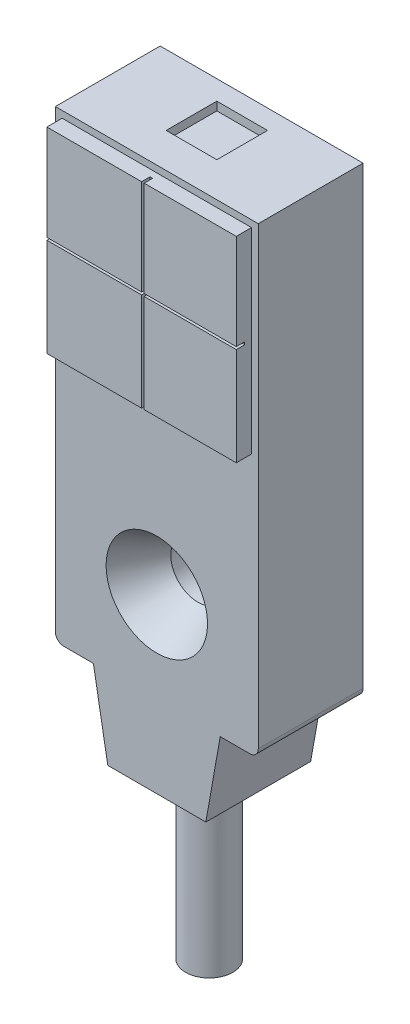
ISO-10303-21;
HEADER;
FILE_DESCRIPTION(('STEP AP214'),'2;1');
FILE_NAME('part.step','',(''),(''),'','','');
FILE_SCHEMA(('AUTOMOTIVE_DESIGN { 1 0 10303 214 1 1 1 1 }'));
ENDSEC;
DATA;
#1=APPLICATION_CONTEXT('core data for automotive mechanical design processes');
#2=APPLICATION_PROTOCOL_DEFINITION('international standard','automotive_design',2000,#1);
#3=PRODUCT_CONTEXT('',#1,'mechanical');
#4=PRODUCT('Part','Part','',(#3));
#5=PRODUCT_RELATED_PRODUCT_CATEGORY('part','',(#4));
#6=PRODUCT_DEFINITION_FORMATION('','',#4);
#7=PRODUCT_DEFINITION_CONTEXT('part definition',#1,'design');
#8=PRODUCT_DEFINITION('design','',#6,#7);
#9=PRODUCT_DEFINITION_SHAPE('','',#8);
#10=(LENGTH_UNIT() NAMED_UNIT(*) SI_UNIT(.MILLI.,.METRE.));
#11=(NAMED_UNIT(*) PLANE_ANGLE_UNIT() SI_UNIT($,.RADIAN.));
#12=(NAMED_UNIT(*) SI_UNIT($,.STERADIAN.) SOLID_ANGLE_UNIT());
#13=UNCERTAINTY_MEASURE_WITH_UNIT(LENGTH_MEASURE(1.E-05),#10,'distance_accuracy_value','');
#14=(GEOMETRIC_REPRESENTATION_CONTEXT(3) GLOBAL_UNCERTAINTY_ASSIGNED_CONTEXT((#13)) GLOBAL_UNIT_ASSIGNED_CONTEXT((#10,
#11,#12)) REPRESENTATION_CONTEXT('',''));
#15=CARTESIAN_POINT('',(0.,0.,0.));
#16=DIRECTION('',(0.,0.,1.));
#17=DIRECTION('',(1.,0.,0.));
#18=AXIS2_PLACEMENT_3D('',#15,#16,#17);
#19=CARTESIAN_POINT('',(0.,0.,7.1));
#20=DIRECTION('',(0.,0.,-1.));
#21=DIRECTION('',(-1.,0.,0.));
#22=AXIS2_PLACEMENT_3D('',#19,#20,#21);
#23=PLANE('',#22);
#24=DIRECTION('',(-1.,0.,0.));
#25=VECTOR('',#24,1.);
#26=CARTESIAN_POINT('',(0.4,27.,7.1));
#27=LINE('',#26,#25);
#28=CARTESIAN_POINT('',(11.6,27.,7.1));
#29=VERTEX_POINT('',#28);
#30=CARTESIAN_POINT('',(6.15,27.,7.1));
#31=VERTEX_POINT('',#30);
#32=EDGE_CURVE('E363',#29,#31,#27,.T.);
#33=ORIENTED_EDGE('',*,*,#32,.T.);
#34=DIRECTION('',(0.,1.,0.));
#35=VECTOR('',#34,1.);
#36=CARTESIAN_POINT('',(6.15,27.,7.1));
#37=LINE('',#36,#35);
#38=CARTESIAN_POINT('',(6.15,21.35,7.1));
#39=VERTEX_POINT('',#38);
#40=EDGE_CURVE('E280',#39,#31,#37,.T.);
#41=ORIENTED_EDGE('',*,*,#40,.F.);
#42=DIRECTION('',(-1.,0.,0.));
#43=VECTOR('',#42,1.);
#44=CARTESIAN_POINT('',(6.15,21.35,7.1));
#45=LINE('',#44,#43);
#46=CARTESIAN_POINT('',(11.6,21.35,7.1));
#47=VERTEX_POINT('',#46);
#48=EDGE_CURVE('E326',#47,#39,#45,.T.);
#49=ORIENTED_EDGE('',*,*,#48,.F.);
#50=DIRECTION('',(0.,1.,0.));
#51=VECTOR('',#50,1.);
#52=CARTESIAN_POINT('',(11.6,27.,7.1));
#53=LINE('',#52,#51);
#54=EDGE_CURVE('E362',#47,#29,#53,.T.);
#55=ORIENTED_EDGE('',*,*,#54,.T.);
#56=EDGE_LOOP('',(#33,#41,#49,#55));
#57=FACE_BOUND('',#56,.T.);
#58=ADVANCED_FACE('F35',(#57),#23,.F.);
#59=CARTESIAN_POINT('',(11.6,15.4,7.1));
#60=VERTEX_POINT('',#59);
#61=CARTESIAN_POINT('',(11.6,21.2,7.1));
#62=VERTEX_POINT('',#61);
#63=EDGE_CURVE('E358',#60,#62,#53,.T.);
#64=ORIENTED_EDGE('',*,*,#63,.T.);
#65=DIRECTION('',(1.,0.,0.));
#66=VECTOR('',#65,1.);
#67=CARTESIAN_POINT('',(11.6,21.2,7.1));
#68=LINE('',#67,#66);
#69=CARTESIAN_POINT('',(6.15,21.2,7.1));
#70=VERTEX_POINT('',#69);
#71=EDGE_CURVE('E324',#70,#62,#68,.T.);
#72=ORIENTED_EDGE('',*,*,#71,.F.);
#73=DIRECTION('',(0.,1.,0.));
#74=VECTOR('',#73,1.);
#75=CARTESIAN_POINT('',(6.15,21.2,7.1));
#76=LINE('',#75,#74);
#77=CARTESIAN_POINT('',(6.15,15.4,7.1));
#78=VERTEX_POINT('',#77);
#79=EDGE_CURVE('E321',#78,#70,#76,.T.);
#80=ORIENTED_EDGE('',*,*,#79,.F.);
#81=DIRECTION('',(1.,0.,0.));
#82=VECTOR('',#81,1.);
#83=CARTESIAN_POINT('',(11.6,15.4,7.1));
#84=LINE('',#83,#82);
#85=EDGE_CURVE('E370',#78,#60,#84,.T.);
#86=ORIENTED_EDGE('',*,*,#85,.T.);
#87=EDGE_LOOP('',(#64,#72,#80,#86));
#88=FACE_BOUND('',#87,.T.);
#89=ADVANCED_FACE('F564',(#88),#23,.F.);
#90=CARTESIAN_POINT('',(0.4,15.4,7.1));
#91=VERTEX_POINT('',#90);
#92=CARTESIAN_POINT('',(6.,15.4,7.1));
#93=VERTEX_POINT('',#92);
#94=EDGE_CURVE('E371',#91,#93,#84,.T.);
#95=ORIENTED_EDGE('',*,*,#94,.T.);
#96=DIRECTION('',(0.,-1.,0.));
#97=VECTOR('',#96,1.);
#98=CARTESIAN_POINT('',(6.,21.2,7.1));
#99=LINE('',#98,#97);
#100=CARTESIAN_POINT('',(6.,21.2,7.1));
#101=VERTEX_POINT('',#100);
#102=EDGE_CURVE('E319',#101,#93,#99,.T.);
#103=ORIENTED_EDGE('',*,*,#102,.F.);
#104=DIRECTION('',(1.,0.,0.));
#105=VECTOR('',#104,1.);
#106=CARTESIAN_POINT('',(6.,21.2,7.1));
#107=LINE('',#106,#105);
#108=CARTESIAN_POINT('',(0.4,21.2,7.1));
#109=VERTEX_POINT('',#108);
#110=EDGE_CURVE('E316',#109,#101,#107,.T.);
#111=ORIENTED_EDGE('',*,*,#110,.F.);
#112=DIRECTION('',(0.,-1.,0.));
#113=VECTOR('',#112,1.);
#114=CARTESIAN_POINT('',(0.4,15.4,7.1));
#115=LINE('',#114,#113);
#116=EDGE_CURVE('E366',#109,#91,#115,.T.);
#117=ORIENTED_EDGE('',*,*,#116,.T.);
#118=EDGE_LOOP('',(#95,#103,#111,#117));
#119=FACE_BOUND('',#118,.T.);
#120=ADVANCED_FACE('F571',(#119),#23,.F.);
#121=CARTESIAN_POINT('',(11.5,0.5,6.2));
#122=DIRECTION('',(0.,0.,-1.));
#123=DIRECTION('',(-1.,0.,0.));
#124=AXIS2_PLACEMENT_3D('',#121,#122,#123);
#125=PLANE('',#124);
#126=CARTESIAN_POINT('',(6.,5.4,6.2));
#127=DIRECTION('',(0.,0.,-1.));
#128=DIRECTION('',(-1.,0.,0.));
#129=AXIS2_PLACEMENT_3D('',#126,#127,#128);
#130=CIRCLE('',#129,3.00000000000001);
#131=CARTESIAN_POINT('',(2.99999999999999,5.4,6.2));
#132=VERTEX_POINT('',#131);
#133=EDGE_CURVE('E43',#132,#132,#130,.T.);
#134=ORIENTED_EDGE('',*,*,#133,.T.);
#135=EDGE_LOOP('',(#134));
#136=FACE_BOUND('',#135,.T.);
#137=DIRECTION('',(-1.,0.,0.));
#138=VECTOR('',#137,1.);
#139=CARTESIAN_POINT('',(0.,27.4,6.2));
#140=LINE('',#139,#138);
#141=CARTESIAN_POINT('',(12.,27.4,6.2));
#142=VERTEX_POINT('',#141);
#143=CARTESIAN_POINT('',(0.,27.4,6.2));
#144=VERTEX_POINT('',#143);
#145=EDGE_CURVE('E398',#142,#144,#140,.T.);
#146=ORIENTED_EDGE('',*,*,#145,.T.);
#147=DIRECTION('',(0.,-1.,0.));
#148=VECTOR('',#147,1.);
#149=CARTESIAN_POINT('',(0.,0.500000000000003,6.2));
#150=LINE('',#149,#148);
#151=CARTESIAN_POINT('',(0.,0.500000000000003,6.2));
#152=VERTEX_POINT('',#151);
#153=EDGE_CURVE('E401',#144,#152,#150,.T.);
#154=ORIENTED_EDGE('',*,*,#153,.T.);
#155=CARTESIAN_POINT('',(0.5,0.5,6.2));
#156=DIRECTION('',(0.,0.,1.));
#157=DIRECTION('',(1.,0.,0.));
#158=AXIS2_PLACEMENT_3D('',#155,#156,#157);
#159=CIRCLE('',#158,0.5);
#160=CARTESIAN_POINT('',(0.500000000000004,0.,6.2));
#161=VERTEX_POINT('',#160);
#162=EDGE_CURVE('E404',#152,#161,#159,.T.);
#163=ORIENTED_EDGE('',*,*,#162,.T.);
#164=DIRECTION('',(1.,0.,0.));
#165=VECTOR('',#164,1.);
#166=CARTESIAN_POINT('',(0.500000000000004,0.,6.2));
#167=LINE('',#166,#165);
#168=CARTESIAN_POINT('',(2.25,0.,6.2));
#169=VERTEX_POINT('',#168);
#170=EDGE_CURVE('E406',#161,#169,#167,.T.);
#171=ORIENTED_EDGE('',*,*,#170,.T.);
#172=DIRECTION('',(0.174370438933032,-0.984680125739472,0.));
#173=VECTOR('',#172,1.);
#174=CARTESIAN_POINT('',(3.1,-4.8,6.2));
#175=LINE('',#174,#173);
#176=CARTESIAN_POINT('',(3.1,-4.8,6.2));
#177=VERTEX_POINT('',#176);
#178=EDGE_CURVE('E408',#169,#177,#175,.T.);
#179=ORIENTED_EDGE('',*,*,#178,.T.);
#180=DIRECTION('',(1.,0.,0.));
#181=VECTOR('',#180,1.);
#182=CARTESIAN_POINT('',(6.,-4.8,6.2));
#183=LINE('',#182,#181);
#184=CARTESIAN_POINT('',(8.9,-4.8,6.2));
#185=VERTEX_POINT('',#184);
#186=EDGE_CURVE('E410',#177,#185,#183,.T.);
#187=ORIENTED_EDGE('',*,*,#186,.T.);
#188=DIRECTION('',(0.174370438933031,0.984680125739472,0.));
#189=VECTOR('',#188,1.);
#190=CARTESIAN_POINT('',(8.9,-4.8,6.2));
#191=LINE('',#190,#189);
#192=CARTESIAN_POINT('',(9.75,0.,6.2));
#193=VERTEX_POINT('',#192);
#194=EDGE_CURVE('E412',#185,#193,#191,.T.);
#195=ORIENTED_EDGE('',*,*,#194,.T.);
#196=DIRECTION('',(1.,0.,0.));
#197=VECTOR('',#196,1.);
#198=CARTESIAN_POINT('',(11.5,0.,6.2));
#199=LINE('',#198,#197);
#200=CARTESIAN_POINT('',(11.5,0.,6.2));
#201=VERTEX_POINT('',#200);
#202=EDGE_CURVE('E414',#193,#201,#199,.T.);
#203=ORIENTED_EDGE('',*,*,#202,.T.);
#204=CARTESIAN_POINT('',(11.5,0.5,6.2));
#205=DIRECTION('',(0.,0.,1.));
#206=DIRECTION('',(-1.,0.,0.));
#207=AXIS2_PLACEMENT_3D('',#204,#205,#206);
#208=CIRCLE('',#207,0.5);
#209=CARTESIAN_POINT('',(12.,0.500000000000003,6.2));
#210=VERTEX_POINT('',#209);
#211=EDGE_CURVE('E416',#201,#210,#208,.T.);
#212=ORIENTED_EDGE('',*,*,#211,.T.);
#213=DIRECTION('',(0.,1.,0.));
#214=VECTOR('',#213,1.);
#215=CARTESIAN_POINT('',(12.,27.4,6.2));
#216=LINE('',#215,#214);
#217=EDGE_CURVE('E418',#210,#142,#216,.T.);
#218=ORIENTED_EDGE('',*,*,#217,.T.);
#219=EDGE_LOOP('',(#146,#154,#163,#171,#179,#187,#195,#203,#212,#218));
#220=FACE_BOUND('',#219,.T.);
#221=DIRECTION('',(0.,1.,0.));
#222=VECTOR('',#221,1.);
#223=CARTESIAN_POINT('',(11.6,27.,6.2));
#224=LINE('',#223,#222);
#225=CARTESIAN_POINT('',(11.6,15.4,6.2));
#226=VERTEX_POINT('',#225);
#227=CARTESIAN_POINT('',(11.6,27.,6.2));
#228=VERTEX_POINT('',#227);
#229=EDGE_CURVE('E333',#226,#228,#224,.T.);
#230=ORIENTED_EDGE('',*,*,#229,.F.);
#231=DIRECTION('',(1.,0.,0.));
#232=VECTOR('',#231,1.);
#233=CARTESIAN_POINT('',(11.6,15.4,6.2));
#234=LINE('',#233,#232);
#235=CARTESIAN_POINT('',(0.399999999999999,15.4,6.2));
#236=VERTEX_POINT('',#235);
#237=EDGE_CURVE('E383',#236,#226,#234,.T.);
#238=ORIENTED_EDGE('',*,*,#237,.F.);
#239=DIRECTION('',(0.,-1.,0.));
#240=VECTOR('',#239,1.);
#241=CARTESIAN_POINT('',(0.4,15.4,6.2));
#242=LINE('',#241,#240);
#243=CARTESIAN_POINT('',(0.399999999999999,27.,6.2));
#244=VERTEX_POINT('',#243);
#245=EDGE_CURVE('E380',#244,#236,#242,.T.);
#246=ORIENTED_EDGE('',*,*,#245,.F.);
#247=DIRECTION('',(-1.,0.,0.));
#248=VECTOR('',#247,1.);
#249=CARTESIAN_POINT('',(0.4,27.,6.2));
#250=LINE('',#249,#248);
#251=EDGE_CURVE('E377',#228,#244,#250,.T.);
#252=ORIENTED_EDGE('',*,*,#251,.F.);
#253=EDGE_LOOP('',(#230,#238,#246,#252));
#254=FACE_BOUND('',#253,.T.);
#255=ADVANCED_FACE('F475',(#136,#220,#254),#125,.F.);
#256=CARTESIAN_POINT('',(0.,27.4,6.2));
#257=DIRECTION('',(0.,-1.,0.));
#258=DIRECTION('',(0.,0.,-1.));
#259=AXIS2_PLACEMENT_3D('',#256,#257,#258);
#260=PLANE('',#259);
#261=DIRECTION('',(-1.,0.,0.));
#262=VECTOR('',#261,1.);
#263=CARTESIAN_POINT('',(6.,27.4,1.15));
#264=LINE('',#263,#262);
#265=CARTESIAN_POINT('',(7.5,27.4,1.15));
#266=VERTEX_POINT('',#265);
#267=CARTESIAN_POINT('',(4.5,27.4,1.15));
#268=VERTEX_POINT('',#267);
#269=EDGE_CURVE('E248',#266,#268,#264,.T.);
#270=ORIENTED_EDGE('',*,*,#269,.F.);
#271=DIRECTION('',(0.,0.,-1.));
#272=VECTOR('',#271,1.);
#273=CARTESIAN_POINT('',(7.5,27.4,4.15));
#274=LINE('',#273,#272);
#275=CARTESIAN_POINT('',(7.5,27.4,4.15));
#276=VERTEX_POINT('',#275);
#277=EDGE_CURVE('E50',#276,#266,#274,.T.);
#278=ORIENTED_EDGE('',*,*,#277,.F.);
#279=DIRECTION('',(1.,0.,0.));
#280=VECTOR('',#279,1.);
#281=CARTESIAN_POINT('',(4.5,27.4,4.15));
#282=LINE('',#281,#280);
#283=CARTESIAN_POINT('',(4.5,27.4,4.15));
#284=VERTEX_POINT('',#283);
#285=EDGE_CURVE('E266',#284,#276,#282,.T.);
#286=ORIENTED_EDGE('',*,*,#285,.F.);
#287=DIRECTION('',(0.,0.,1.));
#288=VECTOR('',#287,1.);
#289=CARTESIAN_POINT('',(4.5,27.4,1.15));
#290=LINE('',#289,#288);
#291=EDGE_CURVE('E263',#268,#284,#290,.T.);
#292=ORIENTED_EDGE('',*,*,#291,.F.);
#293=EDGE_LOOP('',(#270,#278,#286,#292));
#294=FACE_BOUND('',#293,.T.);
#295=DIRECTION('',(-1.,0.,0.));
#296=VECTOR('',#295,1.);
#297=CARTESIAN_POINT('',(0.,27.4,0.));
#298=LINE('',#297,#296);
#299=CARTESIAN_POINT('',(12.,27.4,0.));
#300=VERTEX_POINT('',#299);
#301=CARTESIAN_POINT('',(0.,27.4,0.));
#302=VERTEX_POINT('',#301);
#303=EDGE_CURVE('E397',#300,#302,#298,.T.);
#304=ORIENTED_EDGE('',*,*,#303,.T.);
#305=DIRECTION('',(0.,0.,-1.));
#306=VECTOR('',#305,1.);
#307=CARTESIAN_POINT('',(0.,27.4,6.2));
#308=LINE('',#307,#306);
#309=EDGE_CURVE('E467',#144,#302,#308,.T.);
#310=ORIENTED_EDGE('',*,*,#309,.F.);
#311=ORIENTED_EDGE('',*,*,#145,.F.);
#312=DIRECTION('',(0.,0.,-1.));
#313=VECTOR('',#312,1.);
#314=CARTESIAN_POINT('',(12.,27.4,6.2));
#315=LINE('',#314,#313);
#316=EDGE_CURVE('E420',#142,#300,#315,.T.);
#317=ORIENTED_EDGE('',*,*,#316,.T.);
#318=EDGE_LOOP('',(#304,#310,#311,#317));
#319=FACE_BOUND('',#318,.T.);
#320=ADVANCED_FACE('F550',(#294,#319),#260,.F.);
#321=CARTESIAN_POINT('',(0.,0.500000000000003,6.2));
#322=DIRECTION('',(1.,0.,0.));
#323=DIRECTION('',(0.,0.,-1.));
#324=AXIS2_PLACEMENT_3D('',#321,#322,#323);
#325=PLANE('',#324);
#326=DIRECTION('',(0.,-1.,0.));
#327=VECTOR('',#326,1.);
#328=CARTESIAN_POINT('',(0.,0.500000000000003,0.));
#329=LINE('',#328,#327);
#330=CARTESIAN_POINT('',(0.,0.500000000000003,0.));
#331=VERTEX_POINT('',#330);
#332=EDGE_CURVE('E423',#302,#331,#329,.T.);
#333=ORIENTED_EDGE('',*,*,#332,.T.);
#334=DIRECTION('',(0.,0.,-1.));
#335=VECTOR('',#334,1.);
#336=CARTESIAN_POINT('',(0.,0.500000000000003,6.2));
#337=LINE('',#336,#335);
#338=EDGE_CURVE('E464',#152,#331,#337,.T.);
#339=ORIENTED_EDGE('',*,*,#338,.F.);
#340=ORIENTED_EDGE('',*,*,#153,.F.);
#341=ORIENTED_EDGE('',*,*,#309,.T.);
#342=EDGE_LOOP('',(#333,#339,#340,#341));
#343=FACE_BOUND('',#342,.T.);
#344=ADVANCED_FACE('F547',(#343),#325,.F.);
#345=CARTESIAN_POINT('',(0.5,0.5,6.2));
#346=DIRECTION('',(0.,0.,-1.));
#347=DIRECTION('',(-1.,0.,0.));
#348=AXIS2_PLACEMENT_3D('',#345,#346,#347);
#349=CYLINDRICAL_SURFACE('',#348,0.5);
#350=CARTESIAN_POINT('',(0.5,0.5,0.));
#351=DIRECTION('',(0.,0.,1.));
#352=DIRECTION('',(1.,0.,0.));
#353=AXIS2_PLACEMENT_3D('',#350,#351,#352);
#354=CIRCLE('',#353,0.5);
#355=CARTESIAN_POINT('',(0.500000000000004,0.,0.));
#356=VERTEX_POINT('',#355);
#357=EDGE_CURVE('E425',#331,#356,#354,.T.);
#358=ORIENTED_EDGE('',*,*,#357,.T.);
#359=DIRECTION('',(0.,0.,-1.));
#360=VECTOR('',#359,1.);
#361=CARTESIAN_POINT('',(0.500000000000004,0.,6.2));
#362=LINE('',#361,#360);
#363=EDGE_CURVE('E461',#161,#356,#362,.T.);
#364=ORIENTED_EDGE('',*,*,#363,.F.);
#365=ORIENTED_EDGE('',*,*,#162,.F.);
#366=ORIENTED_EDGE('',*,*,#338,.T.);
#367=EDGE_LOOP('',(#358,#364,#365,#366));
#368=FACE_BOUND('',#367,.T.);
#369=ADVANCED_FACE('F544',(#368),#349,.T.);
#370=CARTESIAN_POINT('',(0.500000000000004,0.,6.2));
#371=DIRECTION('',(0.,1.,0.));
#372=DIRECTION('',(-1.,0.,0.));
#373=AXIS2_PLACEMENT_3D('',#370,#371,#372);
#374=PLANE('',#373);
#375=DIRECTION('',(1.,0.,0.));
#376=VECTOR('',#375,1.);
#377=CARTESIAN_POINT('',(0.500000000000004,0.,0.));
#378=LINE('',#377,#376);
#379=CARTESIAN_POINT('',(2.25,0.,0.));
#380=VERTEX_POINT('',#379);
#381=EDGE_CURVE('E427',#356,#380,#378,.T.);
#382=ORIENTED_EDGE('',*,*,#381,.T.);
#383=DIRECTION('',(0.,0.,-1.));
#384=VECTOR('',#383,1.);
#385=CARTESIAN_POINT('',(2.25,0.,6.2));
#386=LINE('',#385,#384);
#387=EDGE_CURVE('E458',#169,#380,#386,.T.);
#388=ORIENTED_EDGE('',*,*,#387,.F.);
#389=ORIENTED_EDGE('',*,*,#170,.F.);
#390=ORIENTED_EDGE('',*,*,#363,.T.);
#391=EDGE_LOOP('',(#382,#388,#389,#390));
#392=FACE_BOUND('',#391,.T.);
#393=ADVANCED_FACE('F540',(#392),#374,.F.);
#394=CARTESIAN_POINT('',(3.1,-4.8,6.2));
#395=DIRECTION('',(0.984680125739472,0.174370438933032,0.));
#396=DIRECTION('',(-0.174370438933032,0.984680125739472,0.));
#397=AXIS2_PLACEMENT_3D('',#394,#395,#396);
#398=PLANE('',#397);
#399=DIRECTION('',(0.174370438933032,-0.984680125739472,0.));
#400=VECTOR('',#399,1.);
#401=CARTESIAN_POINT('',(3.1,-4.8,0.));
#402=LINE('',#401,#400);
#403=CARTESIAN_POINT('',(3.1,-4.8,0.));
#404=VERTEX_POINT('',#403);
#405=EDGE_CURVE('E429',#380,#404,#402,.T.);
#406=ORIENTED_EDGE('',*,*,#405,.T.);
#407=DIRECTION('',(0.,0.,-1.));
#408=VECTOR('',#407,1.);
#409=CARTESIAN_POINT('',(3.1,-4.8,6.2));
#410=LINE('',#409,#408);
#411=EDGE_CURVE('E455',#177,#404,#410,.T.);
#412=ORIENTED_EDGE('',*,*,#411,.F.);
#413=ORIENTED_EDGE('',*,*,#178,.F.);
#414=ORIENTED_EDGE('',*,*,#387,.T.);
#415=EDGE_LOOP('',(#406,#412,#413,#414));
#416=FACE_BOUND('',#415,.T.);
#417=ADVANCED_FACE('F506',(#416),#398,.F.);
#418=CARTESIAN_POINT('',(6.,-4.8,6.2));
#419=DIRECTION('',(0.,1.,0.));
#420=DIRECTION('',(-1.,0.,0.));
#421=AXIS2_PLACEMENT_3D('',#418,#419,#420);
#422=PLANE('',#421);
#423=CARTESIAN_POINT('',(6.,-4.8,3.1));
#424=DIRECTION('',(0.,1.,0.));
#425=DIRECTION('',(-1.,0.,0.));
#426=AXIS2_PLACEMENT_3D('',#423,#424,#425);
#427=CIRCLE('',#426,1.4);
#428=CARTESIAN_POINT('',(4.6,-4.8,3.1));
#429=VERTEX_POINT('',#428);
#430=EDGE_CURVE('E11',#429,#429,#427,.F.);
#431=ORIENTED_EDGE('',*,*,#430,.F.);
#432=EDGE_LOOP('',(#431));
#433=FACE_BOUND('',#432,.T.);
#434=DIRECTION('',(1.,0.,0.));
#435=VECTOR('',#434,1.);
#436=CARTESIAN_POINT('',(6.,-4.8,0.));
#437=LINE('',#436,#435);
#438=CARTESIAN_POINT('',(8.9,-4.8,0.));
#439=VERTEX_POINT('',#438);
#440=EDGE_CURVE('E432',#404,#439,#437,.T.);
#441=ORIENTED_EDGE('',*,*,#440,.T.);
#442=DIRECTION('',(0.,0.,-1.));
#443=VECTOR('',#442,1.);
#444=CARTESIAN_POINT('',(8.9,-4.8,6.2));
#445=LINE('',#444,#443);
#446=EDGE_CURVE('E452',#185,#439,#445,.T.);
#447=ORIENTED_EDGE('',*,*,#446,.F.);
#448=ORIENTED_EDGE('',*,*,#186,.F.);
#449=ORIENTED_EDGE('',*,*,#411,.T.);
#450=EDGE_LOOP('',(#441,#447,#448,#449));
#451=FACE_BOUND('',#450,.T.);
#452=ADVANCED_FACE('F502',(#433,#451),#422,.F.);
#453=CARTESIAN_POINT('',(8.9,-4.8,6.2));
#454=DIRECTION('',(-0.984680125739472,0.174370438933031,0.));
#455=DIRECTION('',(-0.174370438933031,-0.984680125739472,0.));
#456=AXIS2_PLACEMENT_3D('',#453,#454,#455);
#457=PLANE('',#456);
#458=DIRECTION('',(0.174370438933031,0.984680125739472,0.));
#459=VECTOR('',#458,1.);
#460=CARTESIAN_POINT('',(8.9,-4.8,0.));
#461=LINE('',#460,#459);
#462=CARTESIAN_POINT('',(9.75,0.,0.));
#463=VERTEX_POINT('',#462);
#464=EDGE_CURVE('E434',#439,#463,#461,.T.);
#465=ORIENTED_EDGE('',*,*,#464,.T.);
#466=DIRECTION('',(0.,0.,-1.));
#467=VECTOR('',#466,1.);
#468=CARTESIAN_POINT('',(9.75,0.,6.2));
#469=LINE('',#468,#467);
#470=EDGE_CURVE('E449',#193,#463,#469,.T.);
#471=ORIENTED_EDGE('',*,*,#470,.F.);
#472=ORIENTED_EDGE('',*,*,#194,.F.);
#473=ORIENTED_EDGE('',*,*,#446,.T.);
#474=EDGE_LOOP('',(#465,#471,#472,#473));
#475=FACE_BOUND('',#474,.T.);
#476=ADVANCED_FACE('F505',(#475),#457,.F.);
#477=CARTESIAN_POINT('',(11.5,0.,6.2));
#478=DIRECTION('',(0.,1.,0.));
#479=DIRECTION('',(0.,0.,1.));
#480=AXIS2_PLACEMENT_3D('',#477,#478,#479);
#481=PLANE('',#480);
#482=DIRECTION('',(1.,0.,0.));
#483=VECTOR('',#482,1.);
#484=CARTESIAN_POINT('',(11.5,0.,0.));
#485=LINE('',#484,#483);
#486=CARTESIAN_POINT('',(11.5,0.,0.));
#487=VERTEX_POINT('',#486);
#488=EDGE_CURVE('E436',#463,#487,#485,.T.);
#489=ORIENTED_EDGE('',*,*,#488,.T.);
#490=DIRECTION('',(0.,0.,-1.));
#491=VECTOR('',#490,1.);
#492=CARTESIAN_POINT('',(11.5,0.,6.2));
#493=LINE('',#492,#491);
#494=EDGE_CURVE('E446',#201,#487,#493,.T.);
#495=ORIENTED_EDGE('',*,*,#494,.F.);
#496=ORIENTED_EDGE('',*,*,#202,.F.);
#497=ORIENTED_EDGE('',*,*,#470,.T.);
#498=EDGE_LOOP('',(#489,#495,#496,#497));
#499=FACE_BOUND('',#498,.T.);
#500=ADVANCED_FACE('F524',(#499),#481,.F.);
#501=CARTESIAN_POINT('',(11.5,0.5,6.2));
#502=DIRECTION('',(0.,0.,-1.));
#503=DIRECTION('',(-1.,0.,0.));
#504=AXIS2_PLACEMENT_3D('',#501,#502,#503);
#505=CYLINDRICAL_SURFACE('',#504,0.5);
#506=CARTESIAN_POINT('',(11.5,0.5,0.));
#507=DIRECTION('',(0.,0.,1.));
#508=DIRECTION('',(-1.,0.,0.));
#509=AXIS2_PLACEMENT_3D('',#506,#507,#508);
#510=CIRCLE('',#509,0.5);
#511=CARTESIAN_POINT('',(12.,0.500000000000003,0.));
#512=VERTEX_POINT('',#511);
#513=EDGE_CURVE('E438',#487,#512,#510,.T.);
#514=ORIENTED_EDGE('',*,*,#513,.T.);
#515=DIRECTION('',(0.,0.,-1.));
#516=VECTOR('',#515,1.);
#517=CARTESIAN_POINT('',(12.,0.500000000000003,6.2));
#518=LINE('',#517,#516);
#519=EDGE_CURVE('E443',#210,#512,#518,.T.);
#520=ORIENTED_EDGE('',*,*,#519,.F.);
#521=ORIENTED_EDGE('',*,*,#211,.F.);
#522=ORIENTED_EDGE('',*,*,#494,.T.);
#523=EDGE_LOOP('',(#514,#520,#521,#522));
#524=FACE_BOUND('',#523,.T.);
#525=ADVANCED_FACE('F528',(#524),#505,.T.);
#526=CARTESIAN_POINT('',(12.,27.4,6.2));
#527=DIRECTION('',(-1.,0.,0.));
#528=DIRECTION('',(0.,0.,1.));
#529=AXIS2_PLACEMENT_3D('',#526,#527,#528);
#530=PLANE('',#529);
#531=DIRECTION('',(0.,1.,0.));
#532=VECTOR('',#531,1.);
#533=CARTESIAN_POINT('',(12.,27.4,0.));
#534=LINE('',#533,#532);
#535=EDGE_CURVE('E402',#512,#300,#534,.T.);
#536=ORIENTED_EDGE('',*,*,#535,.T.);
#537=ORIENTED_EDGE('',*,*,#316,.F.);
#538=ORIENTED_EDGE('',*,*,#217,.F.);
#539=ORIENTED_EDGE('',*,*,#519,.T.);
#540=EDGE_LOOP('',(#536,#537,#538,#539));
#541=FACE_BOUND('',#540,.T.);
#542=ADVANCED_FACE('F553',(#541),#530,.F.);
#543=CARTESIAN_POINT('',(11.5,0.5,0.));
#544=DIRECTION('',(0.,0.,-1.));
#545=DIRECTION('',(-1.,0.,0.));
#546=AXIS2_PLACEMENT_3D('',#543,#544,#545);
#547=PLANE('',#546);
#548=CARTESIAN_POINT('',(6.,5.4,0.));
#549=DIRECTION('',(0.,0.,1.));
#550=DIRECTION('',(1.,0.,0.));
#551=AXIS2_PLACEMENT_3D('',#548,#549,#550);
#552=CIRCLE('',#551,1.6);
#553=CARTESIAN_POINT('',(7.6,5.4,0.));
#554=VERTEX_POINT('',#553);
#555=EDGE_CURVE('E264',#554,#554,#552,.T.);
#556=ORIENTED_EDGE('',*,*,#555,.T.);
#557=EDGE_LOOP('',(#556));
#558=FACE_BOUND('',#557,.T.);
#559=ORIENTED_EDGE('',*,*,#303,.F.);
#560=ORIENTED_EDGE('',*,*,#535,.F.);
#561=ORIENTED_EDGE('',*,*,#513,.F.);
#562=ORIENTED_EDGE('',*,*,#488,.F.);
#563=ORIENTED_EDGE('',*,*,#464,.F.);
#564=ORIENTED_EDGE('',*,*,#440,.F.);
#565=ORIENTED_EDGE('',*,*,#405,.F.);
#566=ORIENTED_EDGE('',*,*,#381,.F.);
#567=ORIENTED_EDGE('',*,*,#357,.F.);
#568=ORIENTED_EDGE('',*,*,#332,.F.);
#569=EDGE_LOOP('',(#559,#560,#561,#562,#563,#564,#565,#566,#567,#568));
#570=FACE_BOUND('',#569,.T.);
#571=ADVANCED_FACE('F519',(#558,#570),#547,.T.);
#572=CARTESIAN_POINT('',(11.6,27.,7.1));
#573=DIRECTION('',(-1.,0.,0.));
#574=DIRECTION('',(0.,-1.,0.));
#575=AXIS2_PLACEMENT_3D('',#572,#573,#574);
#576=PLANE('',#575);
#577=ORIENTED_EDGE('',*,*,#54,.F.);
#578=DIRECTION('',(0.,0.,1.));
#579=VECTOR('',#578,1.);
#580=CARTESIAN_POINT('',(11.6,21.35,6.6));
#581=LINE('',#580,#579);
#582=CARTESIAN_POINT('',(11.6,21.35,6.6));
#583=VERTEX_POINT('',#582);
#584=EDGE_CURVE('E336',#583,#47,#581,.T.);
#585=ORIENTED_EDGE('',*,*,#584,.F.);
#586=DIRECTION('',(0.,1.,0.));
#587=VECTOR('',#586,1.);
#588=CARTESIAN_POINT('',(11.6,21.35,6.6));
#589=LINE('',#588,#587);
#590=CARTESIAN_POINT('',(11.6,21.2,6.6));
#591=VERTEX_POINT('',#590);
#592=EDGE_CURVE('E304',#591,#583,#589,.T.);
#593=ORIENTED_EDGE('',*,*,#592,.F.);
#594=DIRECTION('',(0.,0.,1.));
#595=VECTOR('',#594,1.);
#596=CARTESIAN_POINT('',(11.6,21.2,6.6));
#597=LINE('',#596,#595);
#598=EDGE_CURVE('E338',#591,#62,#597,.T.);
#599=ORIENTED_EDGE('',*,*,#598,.T.);
#600=ORIENTED_EDGE('',*,*,#63,.F.);
#601=DIRECTION('',(0.,0.,-1.));
#602=VECTOR('',#601,1.);
#603=CARTESIAN_POINT('',(11.6,15.4,7.1));
#604=LINE('',#603,#602);
#605=EDGE_CURVE('E374',#60,#226,#604,.T.);
#606=ORIENTED_EDGE('',*,*,#605,.T.);
#607=ORIENTED_EDGE('',*,*,#229,.T.);
#608=DIRECTION('',(0.,0.,-1.));
#609=VECTOR('',#608,1.);
#610=CARTESIAN_POINT('',(11.6,27.,7.1));
#611=LINE('',#610,#609);
#612=EDGE_CURVE('E394',#29,#228,#611,.T.);
#613=ORIENTED_EDGE('',*,*,#612,.F.);
#614=EDGE_LOOP('',(#577,#585,#593,#599,#600,#606,#607,#613));
#615=FACE_BOUND('',#614,.T.);
#616=ADVANCED_FACE('F560',(#615),#576,.F.);
#617=CARTESIAN_POINT('',(0.4,27.,7.1));
#618=DIRECTION('',(0.,-1.,0.));
#619=DIRECTION('',(0.,0.,-1.));
#620=AXIS2_PLACEMENT_3D('',#617,#618,#619);
#621=PLANE('',#620);
#622=DIRECTION('',(-1.,0.,0.));
#623=VECTOR('',#622,1.);
#624=CARTESIAN_POINT('',(6.,27.,6.6));
#625=LINE('',#624,#623);
#626=CARTESIAN_POINT('',(6.15,27.,6.6));
#627=VERTEX_POINT('',#626);
#628=CARTESIAN_POINT('',(6.,27.,6.6));
#629=VERTEX_POINT('',#628);
#630=EDGE_CURVE('E276',#627,#629,#625,.T.);
#631=ORIENTED_EDGE('',*,*,#630,.F.);
#632=DIRECTION('',(0.,0.,1.));
#633=VECTOR('',#632,1.);
#634=CARTESIAN_POINT('',(6.15,27.,6.6));
#635=LINE('',#634,#633);
#636=EDGE_CURVE('E330',#627,#31,#635,.T.);
#637=ORIENTED_EDGE('',*,*,#636,.T.);
#638=ORIENTED_EDGE('',*,*,#32,.F.);
#639=ORIENTED_EDGE('',*,*,#612,.T.);
#640=ORIENTED_EDGE('',*,*,#251,.T.);
#641=DIRECTION('',(0.,0.,-1.));
#642=VECTOR('',#641,1.);
#643=CARTESIAN_POINT('',(0.4,27.,7.1));
#644=LINE('',#643,#642);
#645=CARTESIAN_POINT('',(0.4,27.,7.1));
#646=VERTEX_POINT('',#645);
#647=EDGE_CURVE('E391',#646,#244,#644,.T.);
#648=ORIENTED_EDGE('',*,*,#647,.F.);
#649=CARTESIAN_POINT('',(6.,27.,7.1));
#650=VERTEX_POINT('',#649);
#651=EDGE_CURVE('E361',#650,#646,#27,.T.);
#652=ORIENTED_EDGE('',*,*,#651,.F.);
#653=DIRECTION('',(0.,0.,1.));
#654=VECTOR('',#653,1.);
#655=CARTESIAN_POINT('',(6.,27.,6.6));
#656=LINE('',#655,#654);
#657=EDGE_CURVE('E58',#629,#650,#656,.T.);
#658=ORIENTED_EDGE('',*,*,#657,.F.);
#659=EDGE_LOOP('',(#631,#637,#638,#639,#640,#648,#652,#658));
#660=FACE_BOUND('',#659,.T.);
#661=ADVANCED_FACE('F616',(#660),#621,.F.);
#662=CARTESIAN_POINT('',(0.4,15.4,7.1));
#663=DIRECTION('',(1.,0.,0.));
#664=DIRECTION('',(0.,0.,-1.));
#665=AXIS2_PLACEMENT_3D('',#662,#663,#664);
#666=PLANE('',#665);
#667=ORIENTED_EDGE('',*,*,#116,.F.);
#668=DIRECTION('',(0.,0.,1.));
#669=VECTOR('',#668,1.);
#670=CARTESIAN_POINT('',(0.4,21.2,6.6));
#671=LINE('',#670,#669);
#672=CARTESIAN_POINT('',(0.4,21.2,6.6));
#673=VERTEX_POINT('',#672);
#674=EDGE_CURVE('E350',#673,#109,#671,.T.);
#675=ORIENTED_EDGE('',*,*,#674,.F.);
#676=DIRECTION('',(0.,-1.,0.));
#677=VECTOR('',#676,1.);
#678=CARTESIAN_POINT('',(0.4,21.2,6.6));
#679=LINE('',#678,#677);
#680=CARTESIAN_POINT('',(0.4,21.35,6.6));
#681=VERTEX_POINT('',#680);
#682=EDGE_CURVE('E286',#681,#673,#679,.T.);
#683=ORIENTED_EDGE('',*,*,#682,.F.);
#684=DIRECTION('',(0.,0.,1.));
#685=VECTOR('',#684,1.);
#686=CARTESIAN_POINT('',(0.4,21.35,6.6));
#687=LINE('',#686,#685);
#688=CARTESIAN_POINT('',(0.4,21.35,7.1));
#689=VERTEX_POINT('',#688);
#690=EDGE_CURVE('E352',#681,#689,#687,.T.);
#691=ORIENTED_EDGE('',*,*,#690,.T.);
#692=EDGE_CURVE('E367',#646,#689,#115,.T.);
#693=ORIENTED_EDGE('',*,*,#692,.F.);
#694=ORIENTED_EDGE('',*,*,#647,.T.);
#695=ORIENTED_EDGE('',*,*,#245,.T.);
#696=DIRECTION('',(0.,0.,-1.));
#697=VECTOR('',#696,1.);
#698=CARTESIAN_POINT('',(0.4,15.4,7.1));
#699=LINE('',#698,#697);
#700=EDGE_CURVE('E388',#91,#236,#699,.T.);
#701=ORIENTED_EDGE('',*,*,#700,.F.);
#702=EDGE_LOOP('',(#667,#675,#683,#691,#693,#694,#695,#701));
#703=FACE_BOUND('',#702,.T.);
#704=ADVANCED_FACE('F586',(#703),#666,.F.);
#705=CARTESIAN_POINT('',(11.6,15.4,7.1));
#706=DIRECTION('',(0.,1.,0.));
#707=DIRECTION('',(0.,0.,1.));
#708=AXIS2_PLACEMENT_3D('',#705,#706,#707);
#709=PLANE('',#708);
#710=ORIENTED_EDGE('',*,*,#85,.F.);
#711=DIRECTION('',(0.,0.,1.));
#712=VECTOR('',#711,1.);
#713=CARTESIAN_POINT('',(6.15,15.4,6.6));
#714=LINE('',#713,#712);
#715=CARTESIAN_POINT('',(6.15,15.4,6.6));
#716=VERTEX_POINT('',#715);
#717=EDGE_CURVE('E343',#716,#78,#714,.T.);
#718=ORIENTED_EDGE('',*,*,#717,.F.);
#719=DIRECTION('',(1.,0.,0.));
#720=VECTOR('',#719,1.);
#721=CARTESIAN_POINT('',(6.15,15.4,6.6));
#722=LINE('',#721,#720);
#723=CARTESIAN_POINT('',(6.,15.4,6.6));
#724=VERTEX_POINT('',#723);
#725=EDGE_CURVE('E295',#724,#716,#722,.T.);
#726=ORIENTED_EDGE('',*,*,#725,.F.);
#727=DIRECTION('',(0.,0.,1.));
#728=VECTOR('',#727,1.);
#729=CARTESIAN_POINT('',(6.,15.4,6.6));
#730=LINE('',#729,#728);
#731=EDGE_CURVE('E345',#724,#93,#730,.T.);
#732=ORIENTED_EDGE('',*,*,#731,.T.);
#733=ORIENTED_EDGE('',*,*,#94,.F.);
#734=ORIENTED_EDGE('',*,*,#700,.T.);
#735=ORIENTED_EDGE('',*,*,#237,.T.);
#736=ORIENTED_EDGE('',*,*,#605,.F.);
#737=EDGE_LOOP('',(#710,#718,#726,#732,#733,#734,#735,#736));
#738=FACE_BOUND('',#737,.T.);
#739=ADVANCED_FACE('F577',(#738),#709,.F.);
#740=ORIENTED_EDGE('',*,*,#692,.T.);
#741=DIRECTION('',(-1.,0.,0.));
#742=VECTOR('',#741,1.);
#743=CARTESIAN_POINT('',(0.4,21.35,7.1));
#744=LINE('',#743,#742);
#745=CARTESIAN_POINT('',(6.,21.35,7.1));
#746=VERTEX_POINT('',#745);
#747=EDGE_CURVE('E314',#746,#689,#744,.T.);
#748=ORIENTED_EDGE('',*,*,#747,.F.);
#749=DIRECTION('',(0.,-1.,0.));
#750=VECTOR('',#749,1.);
#751=CARTESIAN_POINT('',(6.,27.,7.1));
#752=LINE('',#751,#750);
#753=EDGE_CURVE('E272',#650,#746,#752,.T.);
#754=ORIENTED_EDGE('',*,*,#753,.F.);
#755=ORIENTED_EDGE('',*,*,#651,.T.);
#756=EDGE_LOOP('',(#740,#748,#754,#755));
#757=FACE_BOUND('',#756,.T.);
#758=ADVANCED_FACE('F567',(#757),#23,.F.);
#759=CARTESIAN_POINT('',(6.15,27.,6.6));
#760=DIRECTION('',(1.,0.,0.));
#761=DIRECTION('',(0.,0.,-1.));
#762=AXIS2_PLACEMENT_3D('',#759,#760,#761);
#763=PLANE('',#762);
#764=ORIENTED_EDGE('',*,*,#40,.T.);
#765=ORIENTED_EDGE('',*,*,#636,.F.);
#766=DIRECTION('',(0.,1.,0.));
#767=VECTOR('',#766,1.);
#768=CARTESIAN_POINT('',(6.15,27.,6.6));
#769=LINE('',#768,#767);
#770=CARTESIAN_POINT('',(6.15,21.35,6.6));
#771=VERTEX_POINT('',#770);
#772=EDGE_CURVE('E310',#771,#627,#769,.T.);
#773=ORIENTED_EDGE('',*,*,#772,.F.);
#774=DIRECTION('',(0.,0.,1.));
#775=VECTOR('',#774,1.);
#776=CARTESIAN_POINT('',(6.15,21.35,6.6));
#777=LINE('',#776,#775);
#778=EDGE_CURVE('E334',#771,#39,#777,.T.);
#779=ORIENTED_EDGE('',*,*,#778,.T.);
#780=EDGE_LOOP('',(#764,#765,#773,#779));
#781=FACE_BOUND('',#780,.T.);
#782=ADVANCED_FACE('F576',(#781),#763,.F.);
#783=CARTESIAN_POINT('',(6.15,21.35,6.6));
#784=DIRECTION('',(0.,1.,0.));
#785=DIRECTION('',(0.,0.,1.));
#786=AXIS2_PLACEMENT_3D('',#783,#784,#785);
#787=PLANE('',#786);
#788=ORIENTED_EDGE('',*,*,#48,.T.);
#789=ORIENTED_EDGE('',*,*,#778,.F.);
#790=DIRECTION('',(-1.,0.,0.));
#791=VECTOR('',#790,1.);
#792=CARTESIAN_POINT('',(6.15,21.35,6.6));
#793=LINE('',#792,#791);
#794=EDGE_CURVE('E307',#583,#771,#793,.T.);
#795=ORIENTED_EDGE('',*,*,#794,.F.);
#796=ORIENTED_EDGE('',*,*,#584,.T.);
#797=EDGE_LOOP('',(#788,#789,#795,#796));
#798=FACE_BOUND('',#797,.T.);
#799=ADVANCED_FACE('F583',(#798),#787,.F.);
#800=CARTESIAN_POINT('',(11.6,21.2,6.6));
#801=DIRECTION('',(0.,-1.,0.));
#802=DIRECTION('',(0.,0.,-1.));
#803=AXIS2_PLACEMENT_3D('',#800,#801,#802);
#804=PLANE('',#803);
#805=ORIENTED_EDGE('',*,*,#71,.T.);
#806=ORIENTED_EDGE('',*,*,#598,.F.);
#807=DIRECTION('',(1.,0.,0.));
#808=VECTOR('',#807,1.);
#809=CARTESIAN_POINT('',(11.6,21.2,6.6));
#810=LINE('',#809,#808);
#811=CARTESIAN_POINT('',(6.15,21.2,6.6));
#812=VERTEX_POINT('',#811);
#813=EDGE_CURVE('E301',#812,#591,#810,.T.);
#814=ORIENTED_EDGE('',*,*,#813,.F.);
#815=DIRECTION('',(0.,0.,1.));
#816=VECTOR('',#815,1.);
#817=CARTESIAN_POINT('',(6.15,21.2,6.6));
#818=LINE('',#817,#816);
#819=EDGE_CURVE('E341',#812,#70,#818,.T.);
#820=ORIENTED_EDGE('',*,*,#819,.T.);
#821=EDGE_LOOP('',(#805,#806,#814,#820));
#822=FACE_BOUND('',#821,.T.);
#823=ADVANCED_FACE('F653',(#822),#804,.F.);
#824=CARTESIAN_POINT('',(6.15,21.2,6.6));
#825=DIRECTION('',(1.,0.,0.));
#826=DIRECTION('',(0.,0.,-1.));
#827=AXIS2_PLACEMENT_3D('',#824,#825,#826);
#828=PLANE('',#827);
#829=ORIENTED_EDGE('',*,*,#79,.T.);
#830=ORIENTED_EDGE('',*,*,#819,.F.);
#831=DIRECTION('',(0.,1.,0.));
#832=VECTOR('',#831,1.);
#833=CARTESIAN_POINT('',(6.15,21.2,6.6));
#834=LINE('',#833,#832);
#835=EDGE_CURVE('E298',#716,#812,#834,.T.);
#836=ORIENTED_EDGE('',*,*,#835,.F.);
#837=ORIENTED_EDGE('',*,*,#717,.T.);
#838=EDGE_LOOP('',(#829,#830,#836,#837));
#839=FACE_BOUND('',#838,.T.);
#840=ADVANCED_FACE('F628',(#839),#828,.F.);
#841=CARTESIAN_POINT('',(6.,21.2,6.6));
#842=DIRECTION('',(-1.,0.,0.));
#843=DIRECTION('',(0.,-1.,0.));
#844=AXIS2_PLACEMENT_3D('',#841,#842,#843);
#845=PLANE('',#844);
#846=ORIENTED_EDGE('',*,*,#102,.T.);
#847=ORIENTED_EDGE('',*,*,#731,.F.);
#848=DIRECTION('',(0.,-1.,0.));
#849=VECTOR('',#848,1.);
#850=CARTESIAN_POINT('',(6.,21.2,6.6));
#851=LINE('',#850,#849);
#852=CARTESIAN_POINT('',(6.,21.2,6.6));
#853=VERTEX_POINT('',#852);
#854=EDGE_CURVE('E292',#853,#724,#851,.T.);
#855=ORIENTED_EDGE('',*,*,#854,.F.);
#856=DIRECTION('',(0.,0.,1.));
#857=VECTOR('',#856,1.);
#858=CARTESIAN_POINT('',(6.,21.2,6.6));
#859=LINE('',#858,#857);
#860=EDGE_CURVE('E348',#853,#101,#859,.T.);
#861=ORIENTED_EDGE('',*,*,#860,.T.);
#862=EDGE_LOOP('',(#846,#847,#855,#861));
#863=FACE_BOUND('',#862,.T.);
#864=ADVANCED_FACE('F604',(#863),#845,.F.);
#865=CARTESIAN_POINT('',(6.,21.2,6.6));
#866=DIRECTION('',(0.,-1.,0.));
#867=DIRECTION('',(0.,0.,-1.));
#868=AXIS2_PLACEMENT_3D('',#865,#866,#867);
#869=PLANE('',#868);
#870=ORIENTED_EDGE('',*,*,#110,.T.);
#871=ORIENTED_EDGE('',*,*,#860,.F.);
#872=DIRECTION('',(1.,0.,0.));
#873=VECTOR('',#872,1.);
#874=CARTESIAN_POINT('',(6.,21.2,6.6));
#875=LINE('',#874,#873);
#876=EDGE_CURVE('E289',#673,#853,#875,.T.);
#877=ORIENTED_EDGE('',*,*,#876,.F.);
#878=ORIENTED_EDGE('',*,*,#674,.T.);
#879=EDGE_LOOP('',(#870,#871,#877,#878));
#880=FACE_BOUND('',#879,.T.);
#881=ADVANCED_FACE('F610',(#880),#869,.F.);
#882=CARTESIAN_POINT('',(0.4,21.35,6.6));
#883=DIRECTION('',(0.,1.,0.));
#884=DIRECTION('',(0.,0.,1.));
#885=AXIS2_PLACEMENT_3D('',#882,#883,#884);
#886=PLANE('',#885);
#887=ORIENTED_EDGE('',*,*,#747,.T.);
#888=ORIENTED_EDGE('',*,*,#690,.F.);
#889=DIRECTION('',(-1.,0.,0.));
#890=VECTOR('',#889,1.);
#891=CARTESIAN_POINT('',(0.4,21.35,6.6));
#892=LINE('',#891,#890);
#893=CARTESIAN_POINT('',(6.,21.35,6.6));
#894=VERTEX_POINT('',#893);
#895=EDGE_CURVE('E283',#894,#681,#892,.T.);
#896=ORIENTED_EDGE('',*,*,#895,.F.);
#897=DIRECTION('',(0.,0.,1.));
#898=VECTOR('',#897,1.);
#899=CARTESIAN_POINT('',(6.,21.35,6.6));
#900=LINE('',#899,#898);
#901=EDGE_CURVE('E355',#894,#746,#900,.T.);
#902=ORIENTED_EDGE('',*,*,#901,.T.);
#903=EDGE_LOOP('',(#887,#888,#896,#902));
#904=FACE_BOUND('',#903,.T.);
#905=ADVANCED_FACE('F640',(#904),#886,.F.);
#906=CARTESIAN_POINT('',(6.,27.,6.6));
#907=DIRECTION('',(-1.,0.,0.));
#908=DIRECTION('',(0.,-1.,0.));
#909=AXIS2_PLACEMENT_3D('',#906,#907,#908);
#910=PLANE('',#909);
#911=ORIENTED_EDGE('',*,*,#753,.T.);
#912=ORIENTED_EDGE('',*,*,#901,.F.);
#913=DIRECTION('',(0.,-1.,0.));
#914=VECTOR('',#913,1.);
#915=CARTESIAN_POINT('',(6.,27.,6.6));
#916=LINE('',#915,#914);
#917=EDGE_CURVE('E279',#629,#894,#916,.T.);
#918=ORIENTED_EDGE('',*,*,#917,.F.);
#919=ORIENTED_EDGE('',*,*,#657,.T.);
#920=EDGE_LOOP('',(#911,#912,#918,#919));
#921=FACE_BOUND('',#920,.T.);
#922=ADVANCED_FACE('F637',(#921),#910,.F.);
#923=CARTESIAN_POINT('',(0.,0.,6.6));
#924=DIRECTION('',(0.,0.,-1.));
#925=DIRECTION('',(-1.,0.,0.));
#926=AXIS2_PLACEMENT_3D('',#923,#924,#925);
#927=PLANE('',#926);
#928=ORIENTED_EDGE('',*,*,#630,.T.);
#929=ORIENTED_EDGE('',*,*,#917,.T.);
#930=ORIENTED_EDGE('',*,*,#895,.T.);
#931=ORIENTED_EDGE('',*,*,#682,.T.);
#932=ORIENTED_EDGE('',*,*,#876,.T.);
#933=ORIENTED_EDGE('',*,*,#854,.T.);
#934=ORIENTED_EDGE('',*,*,#725,.T.);
#935=ORIENTED_EDGE('',*,*,#835,.T.);
#936=ORIENTED_EDGE('',*,*,#813,.T.);
#937=ORIENTED_EDGE('',*,*,#592,.T.);
#938=ORIENTED_EDGE('',*,*,#794,.T.);
#939=ORIENTED_EDGE('',*,*,#772,.T.);
#940=EDGE_LOOP('',(#928,#929,#930,#931,#932,#933,#934,#935,#936,#937,#938,#939));
#941=FACE_BOUND('',#940,.T.);
#942=ADVANCED_FACE('F606',(#941),#927,.F.);
#943=CARTESIAN_POINT('',(7.5,26.9,4.15));
#944=DIRECTION('',(1.,0.,0.));
#945=DIRECTION('',(0.,0.,-1.));
#946=AXIS2_PLACEMENT_3D('',#943,#944,#945);
#947=PLANE('',#946);
#948=ORIENTED_EDGE('',*,*,#277,.T.);
#949=DIRECTION('',(0.,1.,0.));
#950=VECTOR('',#949,1.);
#951=CARTESIAN_POINT('',(7.5,26.9,1.15));
#952=LINE('',#951,#950);
#953=CARTESIAN_POINT('',(7.5,26.9,1.15));
#954=VERTEX_POINT('',#953);
#955=EDGE_CURVE('E270',#954,#266,#952,.T.);
#956=ORIENTED_EDGE('',*,*,#955,.F.);
#957=DIRECTION('',(0.,0.,-1.));
#958=VECTOR('',#957,1.);
#959=CARTESIAN_POINT('',(7.5,26.9,4.15));
#960=LINE('',#959,#958);
#961=CARTESIAN_POINT('',(7.5,26.9,4.15));
#962=VERTEX_POINT('',#961);
#963=EDGE_CURVE('E241',#962,#954,#960,.T.);
#964=ORIENTED_EDGE('',*,*,#963,.F.);
#965=DIRECTION('',(0.,1.,0.));
#966=VECTOR('',#965,1.);
#967=CARTESIAN_POINT('',(7.5,26.9,4.15));
#968=LINE('',#967,#966);
#969=EDGE_CURVE('E273',#962,#276,#968,.T.);
#970=ORIENTED_EDGE('',*,*,#969,.T.);
#971=EDGE_LOOP('',(#948,#956,#964,#970));
#972=FACE_BOUND('',#971,.T.);
#973=ADVANCED_FACE('F660',(#972),#947,.F.);
#974=CARTESIAN_POINT('',(4.5,26.9,4.15));
#975=DIRECTION('',(0.,0.,1.));
#976=DIRECTION('',(1.,0.,0.));
#977=AXIS2_PLACEMENT_3D('',#974,#975,#976);
#978=PLANE('',#977);
#979=ORIENTED_EDGE('',*,*,#285,.T.);
#980=ORIENTED_EDGE('',*,*,#969,.F.);
#981=DIRECTION('',(1.,0.,0.));
#982=VECTOR('',#981,1.);
#983=CARTESIAN_POINT('',(4.5,26.9,4.15));
#984=LINE('',#983,#982);
#985=CARTESIAN_POINT('',(4.5,26.9,4.15));
#986=VERTEX_POINT('',#985);
#987=EDGE_CURVE('E256',#986,#962,#984,.T.);
#988=ORIENTED_EDGE('',*,*,#987,.F.);
#989=DIRECTION('',(0.,1.,0.));
#990=VECTOR('',#989,1.);
#991=CARTESIAN_POINT('',(4.5,26.9,4.15));
#992=LINE('',#991,#990);
#993=EDGE_CURVE('E252',#986,#284,#992,.T.);
#994=ORIENTED_EDGE('',*,*,#993,.T.);
#995=EDGE_LOOP('',(#979,#980,#988,#994));
#996=FACE_BOUND('',#995,.T.);
#997=ADVANCED_FACE('F665',(#996),#978,.F.);
#998=CARTESIAN_POINT('',(4.5,26.9,1.15));
#999=DIRECTION('',(-1.,0.,0.));
#1000=DIRECTION('',(0.,0.,1.));
#1001=AXIS2_PLACEMENT_3D('',#998,#999,#1000);
#1002=PLANE('',#1001);
#1003=ORIENTED_EDGE('',*,*,#291,.T.);
#1004=ORIENTED_EDGE('',*,*,#993,.F.);
#1005=DIRECTION('',(0.,0.,1.));
#1006=VECTOR('',#1005,1.);
#1007=CARTESIAN_POINT('',(4.5,26.9,1.15));
#1008=LINE('',#1007,#1006);
#1009=CARTESIAN_POINT('',(4.5,26.9,1.15));
#1010=VERTEX_POINT('',#1009);
#1011=EDGE_CURVE('E239',#1010,#986,#1008,.T.);
#1012=ORIENTED_EDGE('',*,*,#1011,.F.);
#1013=DIRECTION('',(0.,1.,0.));
#1014=VECTOR('',#1013,1.);
#1015=CARTESIAN_POINT('',(4.5,26.9,1.15));
#1016=LINE('',#1015,#1014);
#1017=EDGE_CURVE('E245',#1010,#268,#1016,.T.);
#1018=ORIENTED_EDGE('',*,*,#1017,.T.);
#1019=EDGE_LOOP('',(#1003,#1004,#1012,#1018));
#1020=FACE_BOUND('',#1019,.T.);
#1021=ADVANCED_FACE('F254',(#1020),#1002,.F.);
#1022=CARTESIAN_POINT('',(6.,26.9,1.15));
#1023=DIRECTION('',(0.,0.,-1.));
#1024=DIRECTION('',(-1.,0.,0.));
#1025=AXIS2_PLACEMENT_3D('',#1022,#1023,#1024);
#1026=PLANE('',#1025);
#1027=ORIENTED_EDGE('',*,*,#269,.T.);
#1028=ORIENTED_EDGE('',*,*,#1017,.F.);
#1029=DIRECTION('',(-1.,0.,0.));
#1030=VECTOR('',#1029,1.);
#1031=CARTESIAN_POINT('',(7.5,26.9,1.15));
#1032=LINE('',#1031,#1030);
#1033=EDGE_CURVE('E234',#954,#1010,#1032,.T.);
#1034=ORIENTED_EDGE('',*,*,#1033,.F.);
#1035=ORIENTED_EDGE('',*,*,#955,.T.);
#1036=EDGE_LOOP('',(#1027,#1028,#1034,#1035));
#1037=FACE_BOUND('',#1036,.T.);
#1038=ADVANCED_FACE('F246',(#1037),#1026,.F.);
#1039=CARTESIAN_POINT('',(0.,26.9,0.));
#1040=DIRECTION('',(0.,1.,0.));
#1041=DIRECTION('',(0.,0.,1.));
#1042=AXIS2_PLACEMENT_3D('',#1039,#1040,#1041);
#1043=PLANE('',#1042);
#1044=ORIENTED_EDGE('',*,*,#1033,.T.);
#1045=ORIENTED_EDGE('',*,*,#1011,.T.);
#1046=ORIENTED_EDGE('',*,*,#987,.T.);
#1047=ORIENTED_EDGE('',*,*,#963,.T.);
#1048=EDGE_LOOP('',(#1044,#1045,#1046,#1047));
#1049=FACE_BOUND('',#1048,.T.);
#1050=ADVANCED_FACE('F236',(#1049),#1043,.T.);
#1051=CARTESIAN_POINT('',(6.,5.4,4.2));
#1052=DIRECTION('',(0.,0.,1.));
#1053=DIRECTION('',(1.,0.,0.));
#1054=AXIS2_PLACEMENT_3D('',#1051,#1052,#1053);
#1055=CYLINDRICAL_SURFACE('',#1054,1.6);
#1056=CARTESIAN_POINT('',(6.,5.4,3.77512886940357));
#1057=DIRECTION('',(0.,0.,-1.));
#1058=DIRECTION('',(-1.,0.,0.));
#1059=AXIS2_PLACEMENT_3D('',#1056,#1057,#1058);
#1060=CIRCLE('',#1059,1.6);
#1061=CARTESIAN_POINT('',(4.4,5.4,3.77512886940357));
#1062=VERTEX_POINT('',#1061);
#1063=EDGE_CURVE('E470',#1062,#1062,#1060,.F.);
#1064=ORIENTED_EDGE('',*,*,#1063,.T.);
#1065=EDGE_LOOP('',(#1064));
#1066=FACE_BOUND('',#1065,.T.);
#1067=ORIENTED_EDGE('',*,*,#555,.F.);
#1068=EDGE_LOOP('',(#1067));
#1069=FACE_BOUND('',#1068,.T.);
#1070=ADVANCED_FACE('F481',(#1066,#1069),#1055,.F.);
#1071=CARTESIAN_POINT('',(6.,5.4,3.77512886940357));
#1072=DIRECTION('',(0.,0.,1.));
#1073=DIRECTION('',(1.,0.,0.));
#1074=AXIS2_PLACEMENT_3D('',#1071,#1072,#1073);
#1075=CONICAL_SURFACE('',#1074,1.6,0.523598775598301);
#1076=ORIENTED_EDGE('',*,*,#133,.F.);
#1077=EDGE_LOOP('',(#1076));
#1078=FACE_BOUND('',#1077,.T.);
#1079=ORIENTED_EDGE('',*,*,#1063,.F.);
#1080=EDGE_LOOP('',(#1079));
#1081=FACE_BOUND('',#1080,.T.);
#1082=ADVANCED_FACE('F37',(#1078,#1081),#1075,.F.);
#1083=CARTESIAN_POINT('',(6.00000000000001,-14.8,3.1));
#1084=DIRECTION('',(0.,1.,0.));
#1085=DIRECTION('',(-1.,0.,0.));
#1086=AXIS2_PLACEMENT_3D('',#1083,#1084,#1085);
#1087=CYLINDRICAL_SURFACE('',#1086,1.4);
#1088=CARTESIAN_POINT('',(6.00000000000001,-14.8,3.1));
#1089=DIRECTION('',(0.,-1.,0.));
#1090=DIRECTION('',(1.,0.,0.));
#1091=AXIS2_PLACEMENT_3D('',#1088,#1089,#1090);
#1092=CIRCLE('',#1091,1.4);
#1093=CARTESIAN_POINT('',(7.40000000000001,-14.8,3.1));
#1094=VERTEX_POINT('',#1093);
#1095=EDGE_CURVE('E490',#1094,#1094,#1092,.T.);
#1096=ORIENTED_EDGE('',*,*,#1095,.F.);
#1097=EDGE_LOOP('',(#1096));
#1098=FACE_BOUND('',#1097,.T.);
#1099=ORIENTED_EDGE('',*,*,#430,.T.);
#1100=EDGE_LOOP('',(#1099));
#1101=FACE_BOUND('',#1100,.T.);
#1102=ADVANCED_FACE('F480',(#1098,#1101),#1087,.T.);
#1103=CARTESIAN_POINT('',(6.00000000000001,-14.8,3.1));
#1104=DIRECTION('',(0.,-1.,0.));
#1105=DIRECTION('',(1.,0.,0.));
#1106=AXIS2_PLACEMENT_3D('',#1103,#1104,#1105);
#1107=PLANE('',#1106);
#1108=ORIENTED_EDGE('',*,*,#1095,.T.);
#1109=EDGE_LOOP('',(#1108));
#1110=FACE_BOUND('',#1109,.T.);
#1111=ADVANCED_FACE('F495',(#1110),#1107,.T.);
#1112=CLOSED_SHELL('',(#58,#89,#120,#255,#320,#344,#369,#393,#417,#452,#476,#500,#525,#542,#571,
#616,#661,#704,#739,#758,#782,#799,#823,#840,#864,#881,#905,#922,#942,#973,#997,#1021,#1038,
#1050,#1070,#1082,#1102,#1111));
#1113=MANIFOLD_SOLID_BREP('B2',#1112);
#1114=ADVANCED_BREP_SHAPE_REPRESENTATION('',(#18,#1113),#14);
#1115=SHAPE_DEFINITION_REPRESENTATION(#9,#1114);
ENDSEC;
END-ISO-10303-21;
